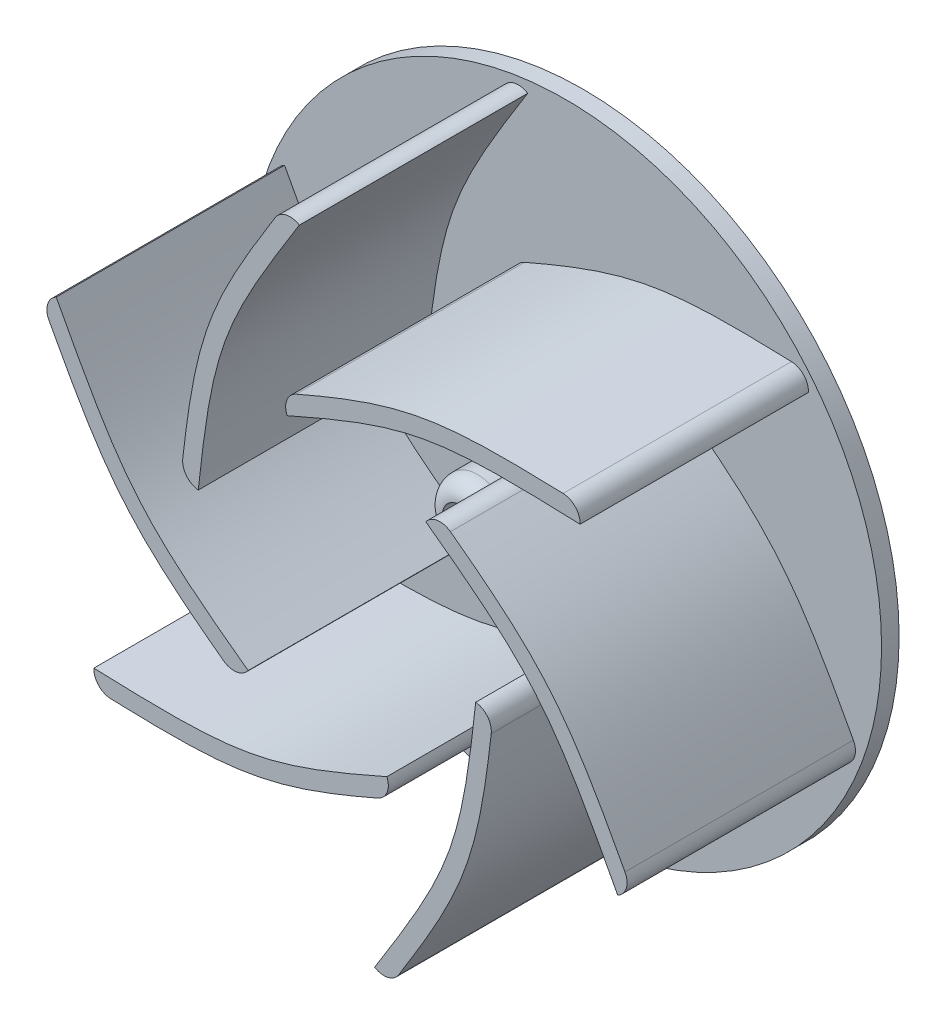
ISO-10303-21;
HEADER;
FILE_DESCRIPTION(('STEP AP214'),'2;1');
FILE_NAME('part.step','',(''),(''),'','','');
FILE_SCHEMA(('AUTOMOTIVE_DESIGN { 1 0 10303 214 1 1 1 1 }'));
ENDSEC;
DATA;
#1=APPLICATION_CONTEXT('core data for automotive mechanical design processes');
#2=APPLICATION_PROTOCOL_DEFINITION('international standard','automotive_design',2000,#1);
#3=PRODUCT_CONTEXT('',#1,'mechanical');
#4=PRODUCT('Part','Part','',(#3));
#5=PRODUCT_RELATED_PRODUCT_CATEGORY('part','',(#4));
#6=PRODUCT_DEFINITION_FORMATION('','',#4);
#7=PRODUCT_DEFINITION_CONTEXT('part definition',#1,'design');
#8=PRODUCT_DEFINITION('design','',#6,#7);
#9=PRODUCT_DEFINITION_SHAPE('','',#8);
#10=(LENGTH_UNIT() NAMED_UNIT(*) SI_UNIT(.MILLI.,.METRE.));
#11=(NAMED_UNIT(*) PLANE_ANGLE_UNIT() SI_UNIT($,.RADIAN.));
#12=(NAMED_UNIT(*) SI_UNIT($,.STERADIAN.) SOLID_ANGLE_UNIT());
#13=UNCERTAINTY_MEASURE_WITH_UNIT(LENGTH_MEASURE(1.E-05),#10,'distance_accuracy_value','');
#14=(GEOMETRIC_REPRESENTATION_CONTEXT(3) GLOBAL_UNCERTAINTY_ASSIGNED_CONTEXT((#13)) GLOBAL_UNIT_ASSIGNED_CONTEXT((#10,
#11,#12)) REPRESENTATION_CONTEXT('',''));
#15=CARTESIAN_POINT('',(0.,0.,0.));
#16=DIRECTION('',(0.,0.,1.));
#17=DIRECTION('',(1.,0.,0.));
#18=AXIS2_PLACEMENT_3D('',#15,#16,#17);
#19=CARTESIAN_POINT('',(0.,0.,0.));
#20=DIRECTION('',(0.,0.,1.));
#21=DIRECTION('',(1.,0.,0.));
#22=AXIS2_PLACEMENT_3D('',#19,#20,#21);
#23=PLANE('',#22);
#24=CARTESIAN_POINT('',(0.,0.,0.));
#25=DIRECTION('',(0.,0.,1.));
#26=DIRECTION('',(1.,0.,0.));
#27=AXIS2_PLACEMENT_3D('',#24,#25,#26);
#28=CIRCLE('',#27,3.);
#29=CARTESIAN_POINT('',(3.,0.,0.));
#30=VERTEX_POINT('',#29);
#31=EDGE_CURVE('E11',#30,#30,#28,.F.);
#32=ORIENTED_EDGE('',*,*,#31,.T.);
#33=EDGE_LOOP('',(#32));
#34=FACE_BOUND('',#33,.T.);
#35=CARTESIAN_POINT('',(0.,0.,0.));
#36=DIRECTION('',(0.,0.,1.));
#37=DIRECTION('',(1.,0.,0.));
#38=AXIS2_PLACEMENT_3D('',#35,#36,#37);
#39=CIRCLE('',#38,18.);
#40=CARTESIAN_POINT('',(-13.8758181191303,-11.4656736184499,0.));
#41=VERTEX_POINT('',#40);
#42=CARTESIAN_POINT('',(2.99165556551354,-17.7496477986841,0.));
#43=VERTEX_POINT('',#42);
#44=EDGE_CURVE('E1087',#41,#43,#39,.T.);
#45=ORIENTED_EDGE('',*,*,#44,.T.);
#46=CARTESIAN_POINT('',(16.8674736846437,-6.28397418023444,0.));
#47=VERTEX_POINT('',#46);
#48=EDGE_CURVE('E292',#43,#47,#39,.T.);
#49=ORIENTED_EDGE('',*,*,#48,.T.);
#50=CARTESIAN_POINT('',(13.8758181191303,11.4656736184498,0.));
#51=VERTEX_POINT('',#50);
#52=EDGE_CURVE('E298',#47,#51,#39,.T.);
#53=ORIENTED_EDGE('',*,*,#52,.T.);
#54=CARTESIAN_POINT('',(-2.99165556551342,17.7496477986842,0.));
#55=VERTEX_POINT('',#54);
#56=EDGE_CURVE('E302',#51,#55,#39,.T.);
#57=ORIENTED_EDGE('',*,*,#56,.T.);
#58=CARTESIAN_POINT('',(-16.8674736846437,6.28397418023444,0.));
#59=VERTEX_POINT('',#58);
#60=EDGE_CURVE('E1092',#55,#59,#39,.T.);
#61=ORIENTED_EDGE('',*,*,#60,.T.);
#62=EDGE_CURVE('E1090',#59,#41,#39,.T.);
#63=ORIENTED_EDGE('',*,*,#62,.T.);
#64=EDGE_LOOP('',(#45,#49,#53,#57,#61,#63));
#65=FACE_BOUND('',#64,.T.);
#66=CARTESIAN_POINT('',(2.67264177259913,-16.3708348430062,0.));
#67=DIRECTION('',(0.,0.,1.));
#68=DIRECTION('',(1.,0.,0.));
#69=AXIS2_PLACEMENT_3D('',#66,#67,#68);
#70=CIRCLE('',#69,1.);
#71=CARTESIAN_POINT('',(3.52226770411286,-16.8982206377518,0.));
#72=VERTEX_POINT('',#71);
#73=CARTESIAN_POINT('',(2.14373937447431,-17.2195175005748,0.));
#74=VERTEX_POINT('',#73);
#75=EDGE_CURVE('E248',#72,#74,#70,.F.);
#76=ORIENTED_EDGE('',*,*,#75,.T.);
#77=CARTESIAN_POINT('',(7.89663166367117,-1.28187689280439,0.));
#78=CARTESIAN_POINT('',(7.07674008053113,-8.91136628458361,0.));
#79=CARTESIAN_POINT('',(6.40891588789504,-10.3975866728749,0.));
#80=CARTESIAN_POINT('',(2.14373937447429,-17.2195175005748,0.));
#81=B_SPLINE_CURVE_WITH_KNOTS('',3,(#77,#78,#79,#80),.UNSPECIFIED.,.F.,.F.,(4,4),(0.,
0.864171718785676),.UNSPECIFIED.);
#82=CARTESIAN_POINT('',(7.89663166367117,-1.28187689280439,0.));
#83=VERTEX_POINT('',#82);
#84=EDGE_CURVE('E62',#83,#74,#81,.T.);
#85=ORIENTED_EDGE('',*,*,#84,.F.);
#86=CARTESIAN_POINT('',(7.78651000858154,-2.27579500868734,0.));
#87=DIRECTION('',(0.,0.,1.));
#88=DIRECTION('',(1.,0.,0.));
#89=AXIS2_PLACEMENT_3D('',#86,#87,#88);
#90=CIRCLE('',#89,1.);
#91=CARTESIAN_POINT('',(8.78000509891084,-2.38966996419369,0.));
#92=VERTEX_POINT('',#91);
#93=EDGE_CURVE('E374',#83,#92,#90,.F.);
#94=ORIENTED_EDGE('',*,*,#93,.T.);
#95=CARTESIAN_POINT('',(2.99165556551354,-17.7496477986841,0.));
#96=CARTESIAN_POINT('',(3.12206136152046,-17.5410704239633,0.));
#97=CARTESIAN_POINT('',(3.3869971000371,-17.1165011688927,0.));
#98=CARTESIAN_POINT('',(3.8788516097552,-16.3235412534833,0.));
#99=CARTESIAN_POINT('',(4.44981063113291,-15.3912618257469,0.));
#100=CARTESIAN_POINT('',(5.0627003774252,-14.3618193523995,0.));
#101=CARTESIAN_POINT('',(5.79400695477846,-13.0800621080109,0.));
#102=CARTESIAN_POINT('',(6.55968512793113,-11.6058919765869,0.));
#103=CARTESIAN_POINT('',(7.27860493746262,-9.90705395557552,0.));
#104=CARTESIAN_POINT('',(7.82881135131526,-8.16171238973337,0.));
#105=CARTESIAN_POINT('',(8.17869186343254,-6.5773524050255,0.));
#106=CARTESIAN_POINT('',(8.4172318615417,-5.16985897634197,0.));
#107=CARTESIAN_POINT('',(8.58149422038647,-4.02806967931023,0.));
#108=CARTESIAN_POINT('',(8.71151419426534,-2.98714418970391,0.));
#109=CARTESIAN_POINT('',(8.81358244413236,-2.09898226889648,0.));
#110=CARTESIAN_POINT('',(8.86574560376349,-1.62286418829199,0.));
#111=CARTESIAN_POINT('',(8.8909069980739,-1.3887251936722,0.));
#112=B_SPLINE_CURVE_WITH_KNOTS('',3,(#95,#96,#97,#98,#99,#100,#101,#102,#103,#104,#105,#106,
#107,#108,#109,#110,#111),.UNSPECIFIED.,.F.,.F.,(4,1,1,1,1,1,1,1,1,1,1,1,1,1,4),(0.,
0.0270053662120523,0.0540107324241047,0.10802146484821,0.162032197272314,0.216042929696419,
0.324064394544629,0.432085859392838,0.540107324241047,0.648128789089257,0.702139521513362,
0.756150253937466,0.810160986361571,0.837166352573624,0.864171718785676),.UNSPECIFIED.);
#113=EDGE_CURVE('E233',#72,#92,#112,.T.);
#114=ORIENTED_EDGE('',*,*,#113,.F.);
#115=EDGE_LOOP('',(#76,#85,#94,#114));
#116=FACE_BOUND('',#115,.T.);
#117=CARTESIAN_POINT('',(-12.8412379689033,-10.4999930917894,0.));
#118=DIRECTION('',(0.,0.,1.));
#119=DIRECTION('',(1.,0.,0.));
#120=AXIS2_PLACEMENT_3D('',#117,#118,#119);
#121=CIRCLE('',#120,1.);
#122=CARTESIAN_POINT('',(-12.8731544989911,-11.4994836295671,0.));
#123=VERTEX_POINT('',#122);
#124=CARTESIAN_POINT('',(-13.8406699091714,-10.4662915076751,0.));
#125=VERTEX_POINT('',#124);
#126=EDGE_CURVE('E254',#123,#125,#121,.F.);
#127=ORIENTED_EDGE('',*,*,#126,.T.);
#128=CARTESIAN_POINT('',(2.8381778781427,-7.47962207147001,0.));
#129=CARTESIAN_POINT('',(-4.17909954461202,-10.5843198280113,0.));
#130=CARTESIAN_POINT('',(-5.80011625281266,-10.7490773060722,0.));
#131=CARTESIAN_POINT('',(-13.8406699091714,-10.4662915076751,0.));
#132=B_SPLINE_CURVE_WITH_KNOTS('',3,(#128,#129,#130,#131),.UNSPECIFIED.,.F.,.F.,(4,4),(0.,
0.864171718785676),.UNSPECIFIED.);
#133=CARTESIAN_POINT('',(2.8381778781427,-7.47962207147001,0.));
#134=VERTEX_POINT('',#133);
#135=EDGE_CURVE('E240',#134,#125,#132,.T.);
#136=ORIENTED_EDGE('',*,*,#135,.F.);
#137=CARTESIAN_POINT('',(1.92235871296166,-7.88121297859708,0.));
#138=DIRECTION('',(0.,0.,1.));
#139=DIRECTION('',(1.,0.,0.));
#140=AXIS2_PLACEMENT_3D('',#137,#138,#139);
#141=CIRCLE('',#140,1.);
#142=CARTESIAN_POINT('',(2.32048765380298,-8.79854244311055,0.));
#143=VERTEX_POINT('',#142);
#144=EDGE_CURVE('E364',#134,#143,#141,.F.);
#145=ORIENTED_EDGE('',*,*,#144,.T.);
#146=CARTESIAN_POINT('',(-13.8758181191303,-11.4656736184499,0.));
#147=CARTESIAN_POINT('',(-13.6299819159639,-11.4743196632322,0.));
#148=CARTESIAN_POINT('',(-13.1298262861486,-11.4914761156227,0.));
#149=CARTESIAN_POINT('',(-12.1971756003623,-11.5209546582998,0.));
#150=CARTESIAN_POINT('',(-11.1043184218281,-11.5492799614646,0.));
#151=CARTESIAN_POINT('',(-9.90635021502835,-11.565336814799,0.));
#152=CARTESIAN_POINT('',(-8.4306625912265,-11.5577882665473,0.));
#153=CARTESIAN_POINT('',(-6.7711547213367,-11.4837999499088,0.));
#154=CARTESIAN_POINT('',(-4.94045793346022,-11.2569837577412,0.));
#155=CARTESIAN_POINT('',(-3.1538445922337,-10.8608057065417,0.));
#156=CARTESIAN_POINT('',(-1.60680834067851,-10.3716311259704,0.));
#157=CARTESIAN_POINT('',(-0.268613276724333,-9.87446610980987,0.));
#158=CARTESIAN_POINT('',(0.80233643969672,-9.44582683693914,0.));
#159=CARTESIAN_POINT('',(1.76881434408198,-9.03796469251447,0.));
#160=CARTESIAN_POINT('',(2.58901925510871,-8.68227742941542,0.));
#161=CARTESIAN_POINT('',(3.02743118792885,-8.48939301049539,0.));
#162=CARTESIAN_POINT('',(3.24278220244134,-8.39411391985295,0.));
#163=B_SPLINE_CURVE_WITH_KNOTS('',3,(#146,#147,#148,#149,#150,#151,#152,#153,#154,#155,#156,
#157,#158,#159,#160,#161,#162),.UNSPECIFIED.,.F.,.F.,(4,1,1,1,1,1,1,1,1,1,1,1,1,1,4),(0.,
0.0270053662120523,0.0540107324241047,0.10802146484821,0.162032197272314,0.216042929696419,
0.324064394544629,0.432085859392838,0.540107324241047,0.648128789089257,0.702139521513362,
0.756150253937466,0.810160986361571,0.837166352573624,0.864171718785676),.UNSPECIFIED.);
#164=EDGE_CURVE('E424',#123,#143,#163,.T.);
#165=ORIENTED_EDGE('',*,*,#164,.F.);
#166=EDGE_LOOP('',(#127,#136,#145,#165));
#167=FACE_BOUND('',#166,.T.);
#168=CARTESIAN_POINT('',(-15.5138797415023,5.87084175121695,0.));
#169=DIRECTION('',(0.,0.,1.));
#170=DIRECTION('',(1.,0.,0.));
#171=AXIS2_PLACEMENT_3D('',#168,#169,#170);
#172=CIRCLE('',#171,1.);
#173=CARTESIAN_POINT('',(-16.3954222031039,5.39873700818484,0.));
#174=VERTEX_POINT('',#173);
#175=CARTESIAN_POINT('',(-15.9844092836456,6.75322599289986,0.));
#176=VERTEX_POINT('',#175);
#177=EDGE_CURVE('E407',#174,#176,#172,.F.);
#178=ORIENTED_EDGE('',*,*,#177,.T.);
#179=CARTESIAN_POINT('',(-5.05845378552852,-6.19774517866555,0.));
#180=CARTESIAN_POINT('',(-11.2558396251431,-1.67295354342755,0.));
#181=CARTESIAN_POINT('',(-12.2090321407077,-0.351490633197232,0.));
#182=CARTESIAN_POINT('',(-15.9844092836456,6.7532259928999,0.));
#183=B_SPLINE_CURVE_WITH_KNOTS('',3,(#179,#180,#181,#182),.UNSPECIFIED.,.F.,.F.,(4,4),(0.,
0.864171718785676),.UNSPECIFIED.);
#184=CARTESIAN_POINT('',(-5.05845378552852,-6.19774517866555,0.));
#185=VERTEX_POINT('',#184);
#186=EDGE_CURVE('E434',#185,#176,#183,.T.);
#187=ORIENTED_EDGE('',*,*,#186,.F.);
#188=CARTESIAN_POINT('',(-5.86415129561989,-5.60541796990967,0.));
#189=DIRECTION('',(0.,0.,1.));
#190=DIRECTION('',(1.,0.,0.));
#191=AXIS2_PLACEMENT_3D('',#188,#189,#190);
#192=CIRCLE('',#191,1.);
#193=CARTESIAN_POINT('',(-6.45951744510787,-6.40887247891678,0.));
#194=VERTEX_POINT('',#193);
#195=EDGE_CURVE('E353',#185,#194,#192,.F.);
#196=ORIENTED_EDGE('',*,*,#195,.T.);
#197=CARTESIAN_POINT('',(-16.8674736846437,6.28397418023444,0.));
#198=CARTESIAN_POINT('',(-16.7520432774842,6.0667507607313,0.));
#199=CARTESIAN_POINT('',(-16.5168233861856,5.6250250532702,0.));
#200=CARTESIAN_POINT('',(-16.0760272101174,4.80258659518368,0.));
#201=CARTESIAN_POINT('',(-15.5541290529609,3.84198186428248,0.));
#202=CARTESIAN_POINT('',(-14.9690505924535,2.79648253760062,0.));
#203=CARTESIAN_POINT('',(-14.2246695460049,1.52227384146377,0.));
#204=CARTESIAN_POINT('',(-13.3308398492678,0.122092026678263,0.));
#205=CARTESIAN_POINT('',(-12.2190628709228,-1.34992980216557,0.));
#206=CARTESIAN_POINT('',(-10.982655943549,-2.69909331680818,0.));
#207=CARTESIAN_POINT('',(-9.78550020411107,-3.7942787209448,0.));
#208=CARTESIAN_POINT('',(-8.68584513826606,-4.7046071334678,0.));
#209=CARTESIAN_POINT('',(-7.77915778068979,-5.41775715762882,0.));
#210=CARTESIAN_POINT('',(-6.94269985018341,-6.05082050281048,0.));
#211=CARTESIAN_POINT('',(-6.22456318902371,-6.58329516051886,0.));
#212=CARTESIAN_POINT('',(-5.8383144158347,-6.86652882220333,0.));
#213=CARTESIAN_POINT('',(-5.64812479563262,-7.00538872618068,0.));
#214=B_SPLINE_CURVE_WITH_KNOTS('',3,(#197,#198,#199,#200,#201,#202,#203,#204,#205,#206,#207,
#208,#209,#210,#211,#212,#213),.UNSPECIFIED.,.F.,.F.,(4,1,1,1,1,1,1,1,1,1,1,1,1,1,4),(0.,
0.0270053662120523,0.0540107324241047,0.10802146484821,0.162032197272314,0.216042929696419,
0.324064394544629,0.432085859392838,0.540107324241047,0.648128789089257,0.702139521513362,
0.756150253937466,0.810160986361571,0.837166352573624,0.864171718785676),.UNSPECIFIED.);
#215=EDGE_CURVE('E439',#174,#194,#214,.T.);
#216=ORIENTED_EDGE('',*,*,#215,.F.);
#217=EDGE_LOOP('',(#178,#187,#196,#216));
#218=FACE_BOUND('',#217,.T.);
#219=CARTESIAN_POINT('',(-2.67264177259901,16.3708348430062,0.));
#220=DIRECTION('',(0.,0.,1.));
#221=DIRECTION('',(1.,0.,0.));
#222=AXIS2_PLACEMENT_3D('',#219,#220,#221);
#223=CIRCLE('',#222,1.);
#224=CARTESIAN_POINT('',(-3.52226770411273,16.8982206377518,0.));
#225=VERTEX_POINT('',#224);
#226=CARTESIAN_POINT('',(-2.14373937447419,17.2195175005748,0.));
#227=VERTEX_POINT('',#226);
#228=EDGE_CURVE('E396',#225,#227,#223,.F.);
#229=ORIENTED_EDGE('',*,*,#228,.T.);
#230=CARTESIAN_POINT('',(-7.89663166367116,1.28187689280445,0.));
#231=CARTESIAN_POINT('',(-7.07674008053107,8.91136628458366,0.));
#232=CARTESIAN_POINT('',(-6.40891588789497,10.3975866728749,0.));
#233=CARTESIAN_POINT('',(-2.14373937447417,17.2195175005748,0.));
#234=B_SPLINE_CURVE_WITH_KNOTS('',3,(#230,#231,#232,#233),.UNSPECIFIED.,.F.,.F.,(4,4),(0.,
0.864171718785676),.UNSPECIFIED.);
#235=CARTESIAN_POINT('',(-7.89663166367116,1.28187689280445,0.));
#236=VERTEX_POINT('',#235);
#237=EDGE_CURVE('E491',#236,#227,#234,.T.);
#238=ORIENTED_EDGE('',*,*,#237,.F.);
#239=CARTESIAN_POINT('',(-7.78651000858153,2.27579500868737,0.));
#240=DIRECTION('',(0.,0.,1.));
#241=DIRECTION('',(1.,0.,0.));
#242=AXIS2_PLACEMENT_3D('',#239,#240,#241);
#243=CIRCLE('',#242,1.);
#244=CARTESIAN_POINT('',(-8.78000509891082,2.38966996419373,0.));
#245=VERTEX_POINT('',#244);
#246=EDGE_CURVE('E342',#236,#245,#243,.F.);
#247=ORIENTED_EDGE('',*,*,#246,.T.);
#248=CARTESIAN_POINT('',(-2.99165556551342,17.7496477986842,0.));
#249=CARTESIAN_POINT('',(-3.12206136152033,17.5410704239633,0.));
#250=CARTESIAN_POINT('',(-3.38699710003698,17.1165011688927,0.));
#251=CARTESIAN_POINT('',(-3.87885160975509,16.3235412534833,0.));
#252=CARTESIAN_POINT('',(-4.4498106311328,15.391261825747,0.));
#253=CARTESIAN_POINT('',(-5.0627003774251,14.3618193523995,0.));
#254=CARTESIAN_POINT('',(-5.79400695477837,13.080062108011,0.));
#255=CARTESIAN_POINT('',(-6.55968512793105,11.6058919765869,0.));
#256=CARTESIAN_POINT('',(-7.27860493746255,9.90705395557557,0.));
#257=CARTESIAN_POINT('',(-7.8288113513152,8.16171238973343,0.));
#258=CARTESIAN_POINT('',(-8.17869186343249,6.57735240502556,0.));
#259=CARTESIAN_POINT('',(-8.41723186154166,5.16985897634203,0.));
#260=CARTESIAN_POINT('',(-8.58149422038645,4.02806967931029,0.));
#261=CARTESIAN_POINT('',(-8.71151419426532,2.98714418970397,0.));
#262=CARTESIAN_POINT('',(-8.81358244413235,2.09898226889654,0.));
#263=CARTESIAN_POINT('',(-8.86574560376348,1.62286418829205,0.));
#264=CARTESIAN_POINT('',(-8.89090699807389,1.38872519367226,0.));
#265=B_SPLINE_CURVE_WITH_KNOTS('',3,(#248,#249,#250,#251,#252,#253,#254,#255,#256,#257,#258,
#259,#260,#261,#262,#263,#264),.UNSPECIFIED.,.F.,.F.,(4,1,1,1,1,1,1,1,1,1,1,1,1,1,4),(0.,
0.0270053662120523,0.0540107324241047,0.10802146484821,0.162032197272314,0.216042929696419,
0.324064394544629,0.432085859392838,0.540107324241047,0.648128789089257,0.702139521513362,
0.756150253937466,0.810160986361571,0.837166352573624,0.864171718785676),.UNSPECIFIED.);
#266=EDGE_CURVE('E499',#225,#245,#265,.T.);
#267=ORIENTED_EDGE('',*,*,#266,.F.);
#268=EDGE_LOOP('',(#229,#238,#247,#267));
#269=FACE_BOUND('',#268,.T.);
#270=CARTESIAN_POINT('',(15.5138797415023,-5.87084175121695,0.));
#271=DIRECTION('',(0.,0.,1.));
#272=DIRECTION('',(1.,0.,0.));
#273=AXIS2_PLACEMENT_3D('',#270,#271,#272);
#274=CIRCLE('',#273,1.);
#275=CARTESIAN_POINT('',(16.3954222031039,-5.39873700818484,0.));
#276=VERTEX_POINT('',#275);
#277=CARTESIAN_POINT('',(15.9844092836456,-6.75322599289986,0.));
#278=VERTEX_POINT('',#277);
#279=EDGE_CURVE('E320',#276,#278,#274,.F.);
#280=ORIENTED_EDGE('',*,*,#279,.T.);
#281=CARTESIAN_POINT('',(5.05845378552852,6.19774517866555,0.));
#282=CARTESIAN_POINT('',(11.2558396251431,1.67295354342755,0.));
#283=CARTESIAN_POINT('',(12.2090321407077,0.351490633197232,0.));
#284=CARTESIAN_POINT('',(15.9844092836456,-6.7532259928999,0.));
#285=B_SPLINE_CURVE_WITH_KNOTS('',3,(#281,#282,#283,#284),.UNSPECIFIED.,.F.,.F.,(4,4),(0.,
0.864171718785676),.UNSPECIFIED.);
#286=CARTESIAN_POINT('',(5.05845378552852,6.19774517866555,0.));
#287=VERTEX_POINT('',#286);
#288=EDGE_CURVE('E567',#287,#278,#285,.T.);
#289=ORIENTED_EDGE('',*,*,#288,.F.);
#290=CARTESIAN_POINT('',(5.86415129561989,5.60541796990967,0.));
#291=DIRECTION('',(0.,0.,1.));
#292=DIRECTION('',(1.,0.,0.));
#293=AXIS2_PLACEMENT_3D('',#290,#291,#292);
#294=CIRCLE('',#293,1.);
#295=CARTESIAN_POINT('',(6.45951744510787,6.40887247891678,0.));
#296=VERTEX_POINT('',#295);
#297=EDGE_CURVE('E309',#287,#296,#294,.F.);
#298=ORIENTED_EDGE('',*,*,#297,.T.);
#299=CARTESIAN_POINT('',(16.8674736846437,-6.28397418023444,0.));
#300=CARTESIAN_POINT('',(16.7520432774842,-6.0667507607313,0.));
#301=CARTESIAN_POINT('',(16.5168233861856,-5.6250250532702,0.));
#302=CARTESIAN_POINT('',(16.0760272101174,-4.80258659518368,0.));
#303=CARTESIAN_POINT('',(15.5541290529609,-3.84198186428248,0.));
#304=CARTESIAN_POINT('',(14.9690505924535,-2.79648253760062,0.));
#305=CARTESIAN_POINT('',(14.2246695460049,-1.52227384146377,0.));
#306=CARTESIAN_POINT('',(13.3308398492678,-0.122092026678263,0.));
#307=CARTESIAN_POINT('',(12.2190628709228,1.34992980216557,0.));
#308=CARTESIAN_POINT('',(10.982655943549,2.69909331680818,0.));
#309=CARTESIAN_POINT('',(9.78550020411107,3.7942787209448,0.));
#310=CARTESIAN_POINT('',(8.68584513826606,4.7046071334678,0.));
#311=CARTESIAN_POINT('',(7.77915778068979,5.41775715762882,0.));
#312=CARTESIAN_POINT('',(6.94269985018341,6.05082050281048,0.));
#313=CARTESIAN_POINT('',(6.22456318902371,6.58329516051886,0.));
#314=CARTESIAN_POINT('',(5.8383144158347,6.86652882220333,0.));
#315=CARTESIAN_POINT('',(5.64812479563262,7.00538872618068,0.));
#316=B_SPLINE_CURVE_WITH_KNOTS('',3,(#299,#300,#301,#302,#303,#304,#305,#306,#307,#308,#309,
#310,#311,#312,#313,#314,#315),.UNSPECIFIED.,.F.,.F.,(4,1,1,1,1,1,1,1,1,1,1,1,1,1,4),(0.,
0.0270053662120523,0.0540107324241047,0.10802146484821,0.162032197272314,0.216042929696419,
0.324064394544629,0.432085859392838,0.540107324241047,0.648128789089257,0.702139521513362,
0.756150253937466,0.810160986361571,0.837166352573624,0.864171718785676),.UNSPECIFIED.);
#317=EDGE_CURVE('E575',#276,#296,#316,.T.);
#318=ORIENTED_EDGE('',*,*,#317,.F.);
#319=EDGE_LOOP('',(#280,#289,#298,#318));
#320=FACE_BOUND('',#319,.T.);
#321=CARTESIAN_POINT('',(12.8412379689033,10.4999930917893,0.));
#322=DIRECTION('',(0.,0.,1.));
#323=DIRECTION('',(1.,0.,0.));
#324=AXIS2_PLACEMENT_3D('',#321,#322,#323);
#325=CIRCLE('',#324,1.);
#326=CARTESIAN_POINT('',(12.8731544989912,11.499483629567,0.));
#327=VERTEX_POINT('',#326);
#328=CARTESIAN_POINT('',(13.8406699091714,10.466291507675,0.));
#329=VERTEX_POINT('',#328);
#330=EDGE_CURVE('E385',#327,#329,#325,.F.);
#331=ORIENTED_EDGE('',*,*,#330,.T.);
#332=CARTESIAN_POINT('',(-2.83817787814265,7.47962207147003,0.));
#333=CARTESIAN_POINT('',(4.17909954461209,10.5843198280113,0.));
#334=CARTESIAN_POINT('',(5.80011625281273,10.7490773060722,0.));
#335=CARTESIAN_POINT('',(13.8406699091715,10.466291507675,0.));
#336=B_SPLINE_CURVE_WITH_KNOTS('',3,(#332,#333,#334,#335),.UNSPECIFIED.,.F.,.F.,(4,4),(0.,
0.864171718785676),.UNSPECIFIED.);
#337=CARTESIAN_POINT('',(-2.83817787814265,7.47962207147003,0.));
#338=VERTEX_POINT('',#337);
#339=EDGE_CURVE('E518',#338,#329,#336,.T.);
#340=ORIENTED_EDGE('',*,*,#339,.F.);
#341=CARTESIAN_POINT('',(-1.92235871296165,7.88121297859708,0.));
#342=DIRECTION('',(0.,0.,1.));
#343=DIRECTION('',(1.,0.,0.));
#344=AXIS2_PLACEMENT_3D('',#341,#342,#343);
#345=CIRCLE('',#344,1.);
#346=CARTESIAN_POINT('',(-2.32048765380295,8.79854244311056,0.));
#347=VERTEX_POINT('',#346);
#348=EDGE_CURVE('E331',#338,#347,#345,.F.);
#349=ORIENTED_EDGE('',*,*,#348,.T.);
#350=CARTESIAN_POINT('',(13.8758181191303,11.4656736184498,0.));
#351=CARTESIAN_POINT('',(13.629981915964,11.4743196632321,0.));
#352=CARTESIAN_POINT('',(13.1298262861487,11.4914761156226,0.));
#353=CARTESIAN_POINT('',(12.1971756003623,11.5209546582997,0.));
#354=CARTESIAN_POINT('',(11.1043184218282,11.5492799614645,0.));
#355=CARTESIAN_POINT('',(9.90635021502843,11.5653368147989,0.));
#356=CARTESIAN_POINT('',(8.43066259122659,11.5577882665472,0.));
#357=CARTESIAN_POINT('',(6.77115472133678,11.4837999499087,0.));
#358=CARTESIAN_POINT('',(4.9404579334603,11.2569837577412,0.));
#359=CARTESIAN_POINT('',(3.15384459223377,10.8608057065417,0.));
#360=CARTESIAN_POINT('',(1.60680834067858,10.3716311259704,0.));
#361=CARTESIAN_POINT('',(0.268613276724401,9.87446610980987,0.));
#362=CARTESIAN_POINT('',(-0.802336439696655,9.44582683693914,0.));
#363=CARTESIAN_POINT('',(-1.76881434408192,9.03796469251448,0.));
#364=CARTESIAN_POINT('',(-2.58901925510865,8.68227742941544,0.));
#365=CARTESIAN_POINT('',(-3.02743118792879,8.48939301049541,0.));
#366=CARTESIAN_POINT('',(-3.24278220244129,8.39411391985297,0.));
#367=B_SPLINE_CURVE_WITH_KNOTS('',3,(#350,#351,#352,#353,#354,#355,#356,#357,#358,#359,#360,
#361,#362,#363,#364,#365,#366),.UNSPECIFIED.,.F.,.F.,(4,1,1,1,1,1,1,1,1,1,1,1,1,1,4),(0.,
0.0270053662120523,0.0540107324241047,0.10802146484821,0.162032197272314,0.216042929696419,
0.324064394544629,0.432085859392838,0.540107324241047,0.648128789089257,0.702139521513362,
0.756150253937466,0.810160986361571,0.837166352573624,0.864171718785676),.UNSPECIFIED.);
#368=EDGE_CURVE('E526',#327,#347,#367,.T.);
#369=ORIENTED_EDGE('',*,*,#368,.F.);
#370=EDGE_LOOP('',(#331,#340,#349,#369));
#371=FACE_BOUND('',#370,.T.);
#372=ADVANCED_FACE('F46',(#34,#65,#116,#167,#218,#269,#320,#371),#23,.T.);
#373=CARTESIAN_POINT('',(0.,0.,-1.));
#374=DIRECTION('',(0.,0.,1.));
#375=DIRECTION('',(1.,0.,0.));
#376=AXIS2_PLACEMENT_3D('',#373,#374,#375);
#377=CYLINDRICAL_SURFACE('',#376,18.);
#378=CARTESIAN_POINT('',(0.,0.,-1.));
#379=DIRECTION('',(0.,0.,1.));
#380=DIRECTION('',(1.,0.,0.));
#381=AXIS2_PLACEMENT_3D('',#378,#379,#380);
#382=CIRCLE('',#381,18.);
#383=CARTESIAN_POINT('',(18.,0.,-1.));
#384=VERTEX_POINT('',#383);
#385=EDGE_CURVE('E293',#384,#384,#382,.T.);
#386=ORIENTED_EDGE('',*,*,#385,.T.);
#387=EDGE_LOOP('',(#386));
#388=FACE_BOUND('',#387,.T.);
#389=ORIENTED_EDGE('',*,*,#52,.F.);
#390=ORIENTED_EDGE('',*,*,#48,.F.);
#391=ORIENTED_EDGE('',*,*,#44,.F.);
#392=ORIENTED_EDGE('',*,*,#62,.F.);
#393=ORIENTED_EDGE('',*,*,#60,.F.);
#394=ORIENTED_EDGE('',*,*,#56,.F.);
#395=EDGE_LOOP('',(#389,#390,#391,#392,#393,#394));
#396=FACE_BOUND('',#395,.T.);
#397=ADVANCED_FACE('F665',(#388,#396),#377,.T.);
#398=CARTESIAN_POINT('',(0.,0.,-1.));
#399=DIRECTION('',(0.,0.,1.));
#400=DIRECTION('',(1.,0.,0.));
#401=AXIS2_PLACEMENT_3D('',#398,#399,#400);
#402=PLANE('',#401);
#403=CARTESIAN_POINT('',(0.,0.,-1.));
#404=DIRECTION('',(0.,0.,1.));
#405=DIRECTION('',(1.,0.,0.));
#406=AXIS2_PLACEMENT_3D('',#403,#404,#405);
#407=CIRCLE('',#406,1.1);
#408=CARTESIAN_POINT('',(1.1,0.,-1.));
#409=VERTEX_POINT('',#408);
#410=EDGE_CURVE('E281',#409,#409,#407,.T.);
#411=ORIENTED_EDGE('',*,*,#410,.T.);
#412=EDGE_LOOP('',(#411));
#413=FACE_BOUND('',#412,.T.);
#414=ORIENTED_EDGE('',*,*,#385,.F.);
#415=EDGE_LOOP('',(#414));
#416=FACE_BOUND('',#415,.T.);
#417=ADVANCED_FACE('F671',(#413,#416),#402,.F.);
#418=CARTESIAN_POINT('',(0.,0.,-1.));
#419=DIRECTION('',(0.,0.,1.));
#420=DIRECTION('',(1.,0.,0.));
#421=AXIS2_PLACEMENT_3D('',#418,#419,#420);
#422=CYLINDRICAL_SURFACE('',#421,1.1);
#423=ORIENTED_EDGE('',*,*,#410,.F.);
#424=EDGE_LOOP('',(#423));
#425=FACE_BOUND('',#424,.T.);
#426=CARTESIAN_POINT('',(0.,0.,0.));
#427=DIRECTION('',(0.,0.,1.));
#428=DIRECTION('',(1.,0.,0.));
#429=AXIS2_PLACEMENT_3D('',#426,#427,#428);
#430=CIRCLE('',#429,1.1);
#431=CARTESIAN_POINT('',(1.1,0.,0.));
#432=VERTEX_POINT('',#431);
#433=EDGE_CURVE('E275',#432,#432,#430,.F.);
#434=ORIENTED_EDGE('',*,*,#433,.F.);
#435=EDGE_LOOP('',(#434));
#436=FACE_BOUND('',#435,.T.);
#437=ADVANCED_FACE('F1026',(#425,#436),#422,.F.);
#438=CARTESIAN_POINT('',(0.,0.,0.));
#439=DIRECTION('',(0.,0.,1.));
#440=DIRECTION('',(1.,0.,0.));
#441=AXIS2_PLACEMENT_3D('',#438,#439,#440);
#442=PLANE('',#441);
#443=CARTESIAN_POINT('',(0.,0.,0.));
#444=DIRECTION('',(0.,0.,1.));
#445=DIRECTION('',(1.,0.,0.));
#446=AXIS2_PLACEMENT_3D('',#443,#444,#445);
#447=CIRCLE('',#446,1.);
#448=CARTESIAN_POINT('',(1.,0.,0.));
#449=VERTEX_POINT('',#448);
#450=EDGE_CURVE('E276',#449,#449,#447,.T.);
#451=ORIENTED_EDGE('',*,*,#450,.T.);
#452=EDGE_LOOP('',(#451));
#453=FACE_BOUND('',#452,.T.);
#454=ORIENTED_EDGE('',*,*,#433,.T.);
#455=EDGE_LOOP('',(#454));
#456=FACE_BOUND('',#455,.T.);
#457=ADVANCED_FACE('F875',(#453,#456),#442,.F.);
#458=CARTESIAN_POINT('',(0.,0.,6.));
#459=DIRECTION('',(0.,0.,-1.));
#460=DIRECTION('',(-1.,0.,0.));
#461=AXIS2_PLACEMENT_3D('',#458,#459,#460);
#462=CYLINDRICAL_SURFACE('',#461,2.);
#463=CARTESIAN_POINT('',(0.,0.,5.));
#464=DIRECTION('',(0.,0.,1.));
#465=DIRECTION('',(1.,0.,0.));
#466=AXIS2_PLACEMENT_3D('',#463,#464,#465);
#467=CIRCLE('',#466,2.);
#468=CARTESIAN_POINT('',(2.,0.,5.));
#469=VERTEX_POINT('',#468);
#470=EDGE_CURVE('E55',#469,#469,#467,.F.);
#471=ORIENTED_EDGE('',*,*,#470,.T.);
#472=EDGE_LOOP('',(#471));
#473=FACE_BOUND('',#472,.T.);
#474=CARTESIAN_POINT('',(0.,0.,1.));
#475=DIRECTION('',(0.,0.,1.));
#476=DIRECTION('',(1.,0.,0.));
#477=AXIS2_PLACEMENT_3D('',#474,#475,#476);
#478=CIRCLE('',#477,2.);
#479=CARTESIAN_POINT('',(2.,0.,1.));
#480=VERTEX_POINT('',#479);
#481=EDGE_CURVE('E252',#480,#480,#478,.T.);
#482=ORIENTED_EDGE('',*,*,#481,.T.);
#483=EDGE_LOOP('',(#482));
#484=FACE_BOUND('',#483,.T.);
#485=ADVANCED_FACE('F264',(#473,#484),#462,.T.);
#486=CARTESIAN_POINT('',(0.,0.,6.));
#487=DIRECTION('',(0.,0.,-1.));
#488=DIRECTION('',(-1.,0.,0.));
#489=AXIS2_PLACEMENT_3D('',#486,#487,#488);
#490=CYLINDRICAL_SURFACE('',#489,1.);
#491=CARTESIAN_POINT('',(0.,0.,6.));
#492=DIRECTION('',(0.,0.,1.));
#493=DIRECTION('',(1.,0.,0.));
#494=AXIS2_PLACEMENT_3D('',#491,#492,#493);
#495=CIRCLE('',#494,1.);
#496=CARTESIAN_POINT('',(1.,0.,6.));
#497=VERTEX_POINT('',#496);
#498=EDGE_CURVE('E272',#497,#497,#495,.T.);
#499=ORIENTED_EDGE('',*,*,#498,.T.);
#500=EDGE_LOOP('',(#499));
#501=FACE_BOUND('',#500,.T.);
#502=ORIENTED_EDGE('',*,*,#450,.F.);
#503=EDGE_LOOP('',(#502));
#504=FACE_BOUND('',#503,.T.);
#505=ADVANCED_FACE('F874',(#501,#504),#490,.F.);
#506=CARTESIAN_POINT('',(5.05845378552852,6.19774517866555,13.));
#507=CARTESIAN_POINT('',(11.2558396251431,1.67295354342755,13.));
#508=CARTESIAN_POINT('',(12.2090321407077,0.351490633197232,13.));
#509=CARTESIAN_POINT('',(15.9844092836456,-6.7532259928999,13.));
#510=B_SPLINE_CURVE_WITH_KNOTS('',3,(#506,#507,#508,#509),.UNSPECIFIED.,.F.,.F.,(4,4),(0.,
0.864171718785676),.UNSPECIFIED.);
#511=DIRECTION('',(0.,0.,-1.));
#512=VECTOR('',#511,1.);
#513=SURFACE_OF_LINEAR_EXTRUSION('',#510,#512);
#514=ORIENTED_EDGE('',*,*,#288,.T.);
#515=DIRECTION('',(0.,0.,-1.));
#516=VECTOR('',#515,1.);
#517=CARTESIAN_POINT('',(15.9844092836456,-6.75322599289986,13.));
#518=LINE('',#517,#516);
#519=CARTESIAN_POINT('',(15.9844092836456,-6.75322599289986,13.));
#520=VERTEX_POINT('',#519);
#521=EDGE_CURVE('E284',#520,#278,#518,.T.);
#522=ORIENTED_EDGE('',*,*,#521,.F.);
#523=CARTESIAN_POINT('',(5.05845378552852,6.19774517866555,13.));
#524=VERTEX_POINT('',#523);
#525=EDGE_CURVE('E562',#524,#520,#510,.T.);
#526=ORIENTED_EDGE('',*,*,#525,.F.);
#527=DIRECTION('',(0.,0.,-1.));
#528=VECTOR('',#527,1.);
#529=CARTESIAN_POINT('',(5.05845378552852,6.19774517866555,13.));
#530=LINE('',#529,#528);
#531=EDGE_CURVE('E561',#524,#287,#530,.T.);
#532=ORIENTED_EDGE('',*,*,#531,.T.);
#533=EDGE_LOOP('',(#514,#522,#526,#532));
#534=FACE_BOUND('',#533,.T.);
#535=ADVANCED_FACE('F551',(#534),#513,.F.);
#536=CARTESIAN_POINT('',(16.8674736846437,-6.28397418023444,13.));
#537=CARTESIAN_POINT('',(16.7520432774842,-6.0667507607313,13.));
#538=CARTESIAN_POINT('',(16.5168233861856,-5.6250250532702,13.));
#539=CARTESIAN_POINT('',(16.0760272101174,-4.80258659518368,13.));
#540=CARTESIAN_POINT('',(15.5541290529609,-3.84198186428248,13.));
#541=CARTESIAN_POINT('',(14.9690505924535,-2.79648253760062,13.));
#542=CARTESIAN_POINT('',(14.2246695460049,-1.52227384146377,13.));
#543=CARTESIAN_POINT('',(13.3308398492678,-0.122092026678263,13.));
#544=CARTESIAN_POINT('',(12.2190628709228,1.34992980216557,13.));
#545=CARTESIAN_POINT('',(10.982655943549,2.69909331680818,13.));
#546=CARTESIAN_POINT('',(9.78550020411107,3.7942787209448,13.));
#547=CARTESIAN_POINT('',(8.68584513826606,4.7046071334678,13.));
#548=CARTESIAN_POINT('',(7.77915778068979,5.41775715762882,13.));
#549=CARTESIAN_POINT('',(6.94269985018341,6.05082050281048,13.));
#550=CARTESIAN_POINT('',(6.22456318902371,6.58329516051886,13.));
#551=CARTESIAN_POINT('',(5.8383144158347,6.86652882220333,13.));
#552=CARTESIAN_POINT('',(5.64812479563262,7.00538872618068,13.));
#553=B_SPLINE_CURVE_WITH_KNOTS('',3,(#536,#537,#538,#539,#540,#541,#542,#543,#544,#545,#546,
#547,#548,#549,#550,#551,#552),.UNSPECIFIED.,.F.,.F.,(4,1,1,1,1,1,1,1,1,1,1,1,1,1,4),(0.,
0.0270053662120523,0.0540107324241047,0.10802146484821,0.162032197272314,0.216042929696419,
0.324064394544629,0.432085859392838,0.540107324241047,0.648128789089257,0.702139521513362,
0.756150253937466,0.810160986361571,0.837166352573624,0.864171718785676),.UNSPECIFIED.);
#554=DIRECTION('',(0.,0.,-1.));
#555=VECTOR('',#554,1.);
#556=SURFACE_OF_LINEAR_EXTRUSION('',#553,#555);
#557=CARTESIAN_POINT('',(16.3954222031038,-5.39873700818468,13.));
#558=VERTEX_POINT('',#557);
#559=CARTESIAN_POINT('',(6.45951744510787,6.40887247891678,13.));
#560=VERTEX_POINT('',#559);
#561=EDGE_CURVE('E555',#558,#560,#553,.T.);
#562=ORIENTED_EDGE('',*,*,#561,.F.);
#563=DIRECTION('',(0.,0.,-1.));
#564=VECTOR('',#563,1.);
#565=CARTESIAN_POINT('',(16.3954222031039,-5.39873700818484,13.));
#566=LINE('',#565,#564);
#567=EDGE_CURVE('E313',#558,#276,#566,.T.);
#568=ORIENTED_EDGE('',*,*,#567,.T.);
#569=ORIENTED_EDGE('',*,*,#317,.T.);
#570=DIRECTION('',(0.,0.,-1.));
#571=VECTOR('',#570,1.);
#572=CARTESIAN_POINT('',(6.45951744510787,6.40887247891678,0.));
#573=LINE('',#572,#571);
#574=EDGE_CURVE('E297',#296,#560,#573,.F.);
#575=ORIENTED_EDGE('',*,*,#574,.T.);
#576=EDGE_LOOP('',(#562,#568,#569,#575));
#577=FACE_BOUND('',#576,.T.);
#578=ADVANCED_FACE('F546',(#577),#556,.F.);
#579=CARTESIAN_POINT('',(11.4296847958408,0.689731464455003,13.));
#580=DIRECTION('',(0.,0.,1.));
#581=DIRECTION('',(1.,0.,0.));
#582=AXIS2_PLACEMENT_3D('',#579,#580,#581);
#583=PLANE('',#582);
#584=ORIENTED_EDGE('',*,*,#525,.T.);
#585=CARTESIAN_POINT('',(15.5138797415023,-5.87084175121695,13.));
#586=DIRECTION('',(0.,0.,1.));
#587=DIRECTION('',(1.,0.,0.));
#588=AXIS2_PLACEMENT_3D('',#585,#586,#587);
#589=CIRCLE('',#588,1.);
#590=EDGE_CURVE('E317',#520,#558,#589,.T.);
#591=ORIENTED_EDGE('',*,*,#590,.T.);
#592=ORIENTED_EDGE('',*,*,#561,.T.);
#593=CARTESIAN_POINT('',(5.86415129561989,5.60541796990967,13.));
#594=DIRECTION('',(0.,0.,1.));
#595=DIRECTION('',(1.,0.,0.));
#596=AXIS2_PLACEMENT_3D('',#593,#594,#595);
#597=CIRCLE('',#596,1.);
#598=EDGE_CURVE('E306',#560,#524,#597,.T.);
#599=ORIENTED_EDGE('',*,*,#598,.T.);
#600=EDGE_LOOP('',(#584,#591,#592,#599));
#601=FACE_BOUND('',#600,.T.);
#602=ADVANCED_FACE('F542',(#601),#583,.T.);
#603=CARTESIAN_POINT('',(5.86415129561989,5.60541796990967,6.5));
#604=DIRECTION('',(0.,0.,-1.));
#605=DIRECTION('',(-1.,0.,0.));
#606=AXIS2_PLACEMENT_3D('',#603,#604,#605);
#607=CYLINDRICAL_SURFACE('',#606,1.);
#608=ORIENTED_EDGE('',*,*,#598,.F.);
#609=ORIENTED_EDGE('',*,*,#574,.F.);
#610=ORIENTED_EDGE('',*,*,#297,.F.);
#611=ORIENTED_EDGE('',*,*,#531,.F.);
#612=EDGE_LOOP('',(#608,#609,#610,#611));
#613=FACE_BOUND('',#612,.T.);
#614=ADVANCED_FACE('F545',(#613),#607,.T.);
#615=CARTESIAN_POINT('',(15.5138797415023,-5.87084175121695,6.50000000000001));
#616=DIRECTION('',(0.,0.,-1.));
#617=DIRECTION('',(-1.,0.,0.));
#618=AXIS2_PLACEMENT_3D('',#615,#616,#617);
#619=CYLINDRICAL_SURFACE('',#618,1.);
#620=ORIENTED_EDGE('',*,*,#590,.F.);
#621=ORIENTED_EDGE('',*,*,#521,.T.);
#622=ORIENTED_EDGE('',*,*,#279,.F.);
#623=ORIENTED_EDGE('',*,*,#567,.F.);
#624=EDGE_LOOP('',(#620,#621,#622,#623));
#625=FACE_BOUND('',#624,.T.);
#626=ADVANCED_FACE('F540',(#625),#619,.T.);
#627=CARTESIAN_POINT('',(-2.83817787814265,7.47962207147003,13.));
#628=CARTESIAN_POINT('',(4.17909954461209,10.5843198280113,13.));
#629=CARTESIAN_POINT('',(5.80011625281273,10.7490773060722,13.));
#630=CARTESIAN_POINT('',(13.8406699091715,10.466291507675,13.));
#631=B_SPLINE_CURVE_WITH_KNOTS('',3,(#627,#628,#629,#630),.UNSPECIFIED.,.F.,.F.,(4,4),(0.,
0.864171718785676),.UNSPECIFIED.);
#632=DIRECTION('',(0.,0.,-1.));
#633=VECTOR('',#632,1.);
#634=SURFACE_OF_LINEAR_EXTRUSION('',#631,#633);
#635=ORIENTED_EDGE('',*,*,#339,.T.);
#636=DIRECTION('',(0.,0.,-1.));
#637=VECTOR('',#636,1.);
#638=CARTESIAN_POINT('',(13.8406699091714,10.466291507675,13.));
#639=LINE('',#638,#637);
#640=CARTESIAN_POINT('',(13.8406699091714,10.466291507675,13.));
#641=VERTEX_POINT('',#640);
#642=EDGE_CURVE('E576',#641,#329,#639,.T.);
#643=ORIENTED_EDGE('',*,*,#642,.F.);
#644=CARTESIAN_POINT('',(-2.83817787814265,7.47962207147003,13.));
#645=VERTEX_POINT('',#644);
#646=EDGE_CURVE('E519',#645,#641,#631,.T.);
#647=ORIENTED_EDGE('',*,*,#646,.F.);
#648=DIRECTION('',(0.,0.,-1.));
#649=VECTOR('',#648,1.);
#650=CARTESIAN_POINT('',(-2.83817787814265,7.47962207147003,13.));
#651=LINE('',#650,#649);
#652=EDGE_CURVE('E608',#645,#338,#651,.T.);
#653=ORIENTED_EDGE('',*,*,#652,.T.);
#654=EDGE_LOOP('',(#635,#643,#647,#653));
#655=FACE_BOUND('',#654,.T.);
#656=ADVANCED_FACE('F535',(#655),#634,.F.);
#657=CARTESIAN_POINT('',(13.8758181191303,11.4656736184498,13.));
#658=CARTESIAN_POINT('',(13.629981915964,11.4743196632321,13.));
#659=CARTESIAN_POINT('',(13.1298262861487,11.4914761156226,13.));
#660=CARTESIAN_POINT('',(12.1971756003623,11.5209546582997,13.));
#661=CARTESIAN_POINT('',(11.1043184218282,11.5492799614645,13.));
#662=CARTESIAN_POINT('',(9.90635021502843,11.5653368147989,13.));
#663=CARTESIAN_POINT('',(8.43066259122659,11.5577882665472,13.));
#664=CARTESIAN_POINT('',(6.77115472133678,11.4837999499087,13.));
#665=CARTESIAN_POINT('',(4.9404579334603,11.2569837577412,13.));
#666=CARTESIAN_POINT('',(3.15384459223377,10.8608057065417,13.));
#667=CARTESIAN_POINT('',(1.60680834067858,10.3716311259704,13.));
#668=CARTESIAN_POINT('',(0.268613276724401,9.87446610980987,13.));
#669=CARTESIAN_POINT('',(-0.802336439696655,9.44582683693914,13.));
#670=CARTESIAN_POINT('',(-1.76881434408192,9.03796469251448,13.));
#671=CARTESIAN_POINT('',(-2.58901925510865,8.68227742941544,13.));
#672=CARTESIAN_POINT('',(-3.02743118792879,8.48939301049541,13.));
#673=CARTESIAN_POINT('',(-3.24278220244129,8.39411391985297,13.));
#674=B_SPLINE_CURVE_WITH_KNOTS('',3,(#657,#658,#659,#660,#661,#662,#663,#664,#665,#666,#667,
#668,#669,#670,#671,#672,#673),.UNSPECIFIED.,.F.,.F.,(4,1,1,1,1,1,1,1,1,1,1,1,1,1,4),(0.,
0.0270053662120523,0.0540107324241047,0.10802146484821,0.162032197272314,0.216042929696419,
0.324064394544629,0.432085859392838,0.540107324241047,0.648128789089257,0.702139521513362,
0.756150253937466,0.810160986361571,0.837166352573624,0.864171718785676),.UNSPECIFIED.);
#675=DIRECTION('',(0.,0.,-1.));
#676=VECTOR('',#675,1.);
#677=SURFACE_OF_LINEAR_EXTRUSION('',#674,#676);
#678=CARTESIAN_POINT('',(12.873154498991,11.499483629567,13.));
#679=VERTEX_POINT('',#678);
#680=CARTESIAN_POINT('',(-2.32048765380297,8.79854244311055,13.));
#681=VERTEX_POINT('',#680);
#682=EDGE_CURVE('E525',#679,#681,#674,.T.);
#683=ORIENTED_EDGE('',*,*,#682,.F.);
#684=DIRECTION('',(0.,0.,-1.));
#685=VECTOR('',#684,1.);
#686=CARTESIAN_POINT('',(12.8731544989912,11.499483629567,13.));
#687=LINE('',#686,#685);
#688=EDGE_CURVE('E378',#679,#327,#687,.T.);
#689=ORIENTED_EDGE('',*,*,#688,.T.);
#690=ORIENTED_EDGE('',*,*,#368,.T.);
#691=DIRECTION('',(0.,0.,-1.));
#692=VECTOR('',#691,1.);
#693=CARTESIAN_POINT('',(-2.32048765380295,8.79854244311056,0.));
#694=LINE('',#693,#692);
#695=EDGE_CURVE('E324',#347,#681,#694,.F.);
#696=ORIENTED_EDGE('',*,*,#695,.T.);
#697=EDGE_LOOP('',(#683,#689,#690,#696));
#698=FACE_BOUND('',#697,.T.);
#699=ADVANCED_FACE('F539',(#698),#677,.F.);
#700=CARTESIAN_POINT('',(5.11751742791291,10.2432631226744,13.));
#701=DIRECTION('',(0.,0.,1.));
#702=DIRECTION('',(0.499999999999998,0.86602540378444,0.));
#703=AXIS2_PLACEMENT_3D('',#700,#701,#702);
#704=PLANE('',#703);
#705=ORIENTED_EDGE('',*,*,#646,.T.);
#706=CARTESIAN_POINT('',(12.8412379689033,10.4999930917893,13.));
#707=DIRECTION('',(0.,0.,1.));
#708=DIRECTION('',(1.,0.,0.));
#709=AXIS2_PLACEMENT_3D('',#706,#707,#708);
#710=CIRCLE('',#709,1.);
#711=EDGE_CURVE('E382',#641,#679,#710,.T.);
#712=ORIENTED_EDGE('',*,*,#711,.T.);
#713=ORIENTED_EDGE('',*,*,#682,.T.);
#714=CARTESIAN_POINT('',(-1.92235871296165,7.88121297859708,13.));
#715=DIRECTION('',(0.,0.,1.));
#716=DIRECTION('',(1.,0.,0.));
#717=AXIS2_PLACEMENT_3D('',#714,#715,#716);
#718=CIRCLE('',#717,1.);
#719=EDGE_CURVE('E328',#681,#645,#718,.T.);
#720=ORIENTED_EDGE('',*,*,#719,.T.);
#721=EDGE_LOOP('',(#705,#712,#713,#720));
#722=FACE_BOUND('',#721,.T.);
#723=ADVANCED_FACE('F710',(#722),#704,.T.);
#724=CARTESIAN_POINT('',(-7.89663166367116,1.28187689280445,13.));
#725=CARTESIAN_POINT('',(-7.07674008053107,8.91136628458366,13.));
#726=CARTESIAN_POINT('',(-6.40891588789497,10.3975866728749,13.));
#727=CARTESIAN_POINT('',(-2.14373937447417,17.2195175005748,13.));
#728=B_SPLINE_CURVE_WITH_KNOTS('',3,(#724,#725,#726,#727),.UNSPECIFIED.,.F.,.F.,(4,4),(0.,
0.864171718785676),.UNSPECIFIED.);
#729=DIRECTION('',(0.,0.,-1.));
#730=VECTOR('',#729,1.);
#731=SURFACE_OF_LINEAR_EXTRUSION('',#728,#730);
#732=ORIENTED_EDGE('',*,*,#237,.T.);
#733=DIRECTION('',(0.,0.,-1.));
#734=VECTOR('',#733,1.);
#735=CARTESIAN_POINT('',(-2.14373937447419,17.2195175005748,13.));
#736=LINE('',#735,#734);
#737=CARTESIAN_POINT('',(-2.14373937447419,17.2195175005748,13.));
#738=VERTEX_POINT('',#737);
#739=EDGE_CURVE('E514',#738,#227,#736,.T.);
#740=ORIENTED_EDGE('',*,*,#739,.F.);
#741=CARTESIAN_POINT('',(-7.89663166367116,1.28187689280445,13.));
#742=VERTEX_POINT('',#741);
#743=EDGE_CURVE('E486',#742,#738,#728,.T.);
#744=ORIENTED_EDGE('',*,*,#743,.F.);
#745=DIRECTION('',(0.,0.,-1.));
#746=VECTOR('',#745,1.);
#747=CARTESIAN_POINT('',(-7.89663166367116,1.28187689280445,13.));
#748=LINE('',#747,#746);
#749=EDGE_CURVE('E485',#742,#236,#748,.T.);
#750=ORIENTED_EDGE('',*,*,#749,.T.);
#751=EDGE_LOOP('',(#732,#740,#744,#750));
#752=FACE_BOUND('',#751,.T.);
#753=ADVANCED_FACE('F475',(#752),#731,.F.);
#754=CARTESIAN_POINT('',(-2.99165556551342,17.7496477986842,13.));
#755=CARTESIAN_POINT('',(-3.12206136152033,17.5410704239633,13.));
#756=CARTESIAN_POINT('',(-3.38699710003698,17.1165011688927,13.));
#757=CARTESIAN_POINT('',(-3.87885160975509,16.3235412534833,13.));
#758=CARTESIAN_POINT('',(-4.4498106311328,15.391261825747,13.));
#759=CARTESIAN_POINT('',(-5.0627003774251,14.3618193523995,13.));
#760=CARTESIAN_POINT('',(-5.79400695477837,13.080062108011,13.));
#761=CARTESIAN_POINT('',(-6.55968512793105,11.6058919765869,13.));
#762=CARTESIAN_POINT('',(-7.27860493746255,9.90705395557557,13.));
#763=CARTESIAN_POINT('',(-7.8288113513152,8.16171238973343,13.));
#764=CARTESIAN_POINT('',(-8.17869186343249,6.57735240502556,13.));
#765=CARTESIAN_POINT('',(-8.41723186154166,5.16985897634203,13.));
#766=CARTESIAN_POINT('',(-8.58149422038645,4.02806967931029,13.));
#767=CARTESIAN_POINT('',(-8.71151419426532,2.98714418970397,13.));
#768=CARTESIAN_POINT('',(-8.81358244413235,2.09898226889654,13.));
#769=CARTESIAN_POINT('',(-8.86574560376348,1.62286418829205,13.));
#770=CARTESIAN_POINT('',(-8.89090699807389,1.38872519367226,13.));
#771=B_SPLINE_CURVE_WITH_KNOTS('',3,(#754,#755,#756,#757,#758,#759,#760,#761,#762,#763,#764,
#765,#766,#767,#768,#769,#770),.UNSPECIFIED.,.F.,.F.,(4,1,1,1,1,1,1,1,1,1,1,1,1,1,4),(0.,
0.0270053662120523,0.0540107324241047,0.10802146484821,0.162032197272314,0.216042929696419,
0.324064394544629,0.432085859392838,0.540107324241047,0.648128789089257,0.702139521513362,
0.756150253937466,0.810160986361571,0.837166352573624,0.864171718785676),.UNSPECIFIED.);
#772=DIRECTION('',(0.,0.,-1.));
#773=VECTOR('',#772,1.);
#774=SURFACE_OF_LINEAR_EXTRUSION('',#771,#773);
#775=CARTESIAN_POINT('',(-3.52226770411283,16.8982206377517,13.));
#776=VERTEX_POINT('',#775);
#777=CARTESIAN_POINT('',(-8.78000509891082,2.38966996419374,13.));
#778=VERTEX_POINT('',#777);
#779=EDGE_CURVE('E479',#776,#778,#771,.T.);
#780=ORIENTED_EDGE('',*,*,#779,.F.);
#781=DIRECTION('',(0.,0.,-1.));
#782=VECTOR('',#781,1.);
#783=CARTESIAN_POINT('',(-3.52226770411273,16.8982206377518,13.));
#784=LINE('',#783,#782);
#785=EDGE_CURVE('E389',#776,#225,#784,.T.);
#786=ORIENTED_EDGE('',*,*,#785,.T.);
#787=ORIENTED_EDGE('',*,*,#266,.T.);
#788=DIRECTION('',(0.,0.,-1.));
#789=VECTOR('',#788,1.);
#790=CARTESIAN_POINT('',(-8.78000509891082,2.38966996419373,0.));
#791=LINE('',#790,#789);
#792=EDGE_CURVE('E335',#245,#778,#791,.F.);
#793=ORIENTED_EDGE('',*,*,#792,.T.);
#794=EDGE_LOOP('',(#780,#786,#787,#793));
#795=FACE_BOUND('',#794,.T.);
#796=ADVANCED_FACE('F470',(#795),#774,.F.);
#797=CARTESIAN_POINT('',(-6.31216736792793,9.55353165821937,13.));
#798=DIRECTION('',(0.,0.,1.));
#799=DIRECTION('',(-0.500000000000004,0.866025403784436,0.));
#800=AXIS2_PLACEMENT_3D('',#797,#798,#799);
#801=PLANE('',#800);
#802=ORIENTED_EDGE('',*,*,#743,.T.);
#803=CARTESIAN_POINT('',(-2.67264177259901,16.3708348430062,13.));
#804=DIRECTION('',(0.,0.,1.));
#805=DIRECTION('',(1.,0.,0.));
#806=AXIS2_PLACEMENT_3D('',#803,#804,#805);
#807=CIRCLE('',#806,1.);
#808=EDGE_CURVE('E393',#738,#776,#807,.T.);
#809=ORIENTED_EDGE('',*,*,#808,.T.);
#810=ORIENTED_EDGE('',*,*,#779,.T.);
#811=CARTESIAN_POINT('',(-7.78651000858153,2.27579500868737,13.));
#812=DIRECTION('',(0.,0.,1.));
#813=DIRECTION('',(1.,0.,0.));
#814=AXIS2_PLACEMENT_3D('',#811,#812,#813);
#815=CIRCLE('',#814,1.);
#816=EDGE_CURVE('E339',#778,#742,#815,.T.);
#817=ORIENTED_EDGE('',*,*,#816,.T.);
#818=EDGE_LOOP('',(#802,#809,#810,#817));
#819=FACE_BOUND('',#818,.T.);
#820=ADVANCED_FACE('F465',(#819),#801,.T.);
#821=CARTESIAN_POINT('',(-5.05845378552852,-6.19774517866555,13.));
#822=CARTESIAN_POINT('',(-11.2558396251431,-1.67295354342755,13.));
#823=CARTESIAN_POINT('',(-12.2090321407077,-0.351490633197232,13.));
#824=CARTESIAN_POINT('',(-15.9844092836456,6.7532259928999,13.));
#825=B_SPLINE_CURVE_WITH_KNOTS('',3,(#821,#822,#823,#824),.UNSPECIFIED.,.F.,.F.,(4,4),(0.,
0.864171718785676),.UNSPECIFIED.);
#826=DIRECTION('',(0.,0.,-1.));
#827=VECTOR('',#826,1.);
#828=SURFACE_OF_LINEAR_EXTRUSION('',#825,#827);
#829=ORIENTED_EDGE('',*,*,#186,.T.);
#830=DIRECTION('',(0.,0.,-1.));
#831=VECTOR('',#830,1.);
#832=CARTESIAN_POINT('',(-15.9844092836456,6.75322599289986,13.));
#833=LINE('',#832,#831);
#834=CARTESIAN_POINT('',(-15.9844092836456,6.75322599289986,13.));
#835=VERTEX_POINT('',#834);
#836=EDGE_CURVE('E500',#835,#176,#833,.T.);
#837=ORIENTED_EDGE('',*,*,#836,.F.);
#838=CARTESIAN_POINT('',(-5.05845378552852,-6.19774517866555,13.));
#839=VERTEX_POINT('',#838);
#840=EDGE_CURVE('E446',#839,#835,#825,.T.);
#841=ORIENTED_EDGE('',*,*,#840,.F.);
#842=DIRECTION('',(0.,0.,-1.));
#843=VECTOR('',#842,1.);
#844=CARTESIAN_POINT('',(-5.05845378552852,-6.19774517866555,13.));
#845=LINE('',#844,#843);
#846=EDGE_CURVE('E619',#839,#185,#845,.T.);
#847=ORIENTED_EDGE('',*,*,#846,.T.);
#848=EDGE_LOOP('',(#829,#837,#841,#847));
#849=FACE_BOUND('',#848,.T.);
#850=ADVANCED_FACE('F460',(#849),#828,.F.);
#851=CARTESIAN_POINT('',(-16.8674736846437,6.28397418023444,13.));
#852=CARTESIAN_POINT('',(-16.7520432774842,6.0667507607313,13.));
#853=CARTESIAN_POINT('',(-16.5168233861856,5.6250250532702,13.));
#854=CARTESIAN_POINT('',(-16.0760272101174,4.80258659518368,13.));
#855=CARTESIAN_POINT('',(-15.5541290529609,3.84198186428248,13.));
#856=CARTESIAN_POINT('',(-14.9690505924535,2.79648253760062,13.));
#857=CARTESIAN_POINT('',(-14.2246695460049,1.52227384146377,13.));
#858=CARTESIAN_POINT('',(-13.3308398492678,0.122092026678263,13.));
#859=CARTESIAN_POINT('',(-12.2190628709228,-1.34992980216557,13.));
#860=CARTESIAN_POINT('',(-10.982655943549,-2.69909331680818,13.));
#861=CARTESIAN_POINT('',(-9.78550020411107,-3.7942787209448,13.));
#862=CARTESIAN_POINT('',(-8.68584513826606,-4.7046071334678,13.));
#863=CARTESIAN_POINT('',(-7.77915778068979,-5.41775715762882,13.));
#864=CARTESIAN_POINT('',(-6.94269985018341,-6.05082050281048,13.));
#865=CARTESIAN_POINT('',(-6.22456318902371,-6.58329516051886,13.));
#866=CARTESIAN_POINT('',(-5.8383144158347,-6.86652882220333,13.));
#867=CARTESIAN_POINT('',(-5.64812479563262,-7.00538872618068,13.));
#868=B_SPLINE_CURVE_WITH_KNOTS('',3,(#851,#852,#853,#854,#855,#856,#857,#858,#859,#860,#861,
#862,#863,#864,#865,#866,#867),.UNSPECIFIED.,.F.,.F.,(4,1,1,1,1,1,1,1,1,1,1,1,1,1,4),(0.,
0.0270053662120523,0.0540107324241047,0.10802146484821,0.162032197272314,0.216042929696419,
0.324064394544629,0.432085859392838,0.540107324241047,0.648128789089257,0.702139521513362,
0.756150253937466,0.810160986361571,0.837166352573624,0.864171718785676),.UNSPECIFIED.);
#869=DIRECTION('',(0.,0.,-1.));
#870=VECTOR('',#869,1.);
#871=SURFACE_OF_LINEAR_EXTRUSION('',#868,#870);
#872=CARTESIAN_POINT('',(-16.3954222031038,5.39873700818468,13.));
#873=VERTEX_POINT('',#872);
#874=CARTESIAN_POINT('',(-6.45951744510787,-6.40887247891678,13.));
#875=VERTEX_POINT('',#874);
#876=EDGE_CURVE('E452',#873,#875,#868,.T.);
#877=ORIENTED_EDGE('',*,*,#876,.F.);
#878=DIRECTION('',(0.,0.,-1.));
#879=VECTOR('',#878,1.);
#880=CARTESIAN_POINT('',(-16.3954222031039,5.39873700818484,13.));
#881=LINE('',#880,#879);
#882=EDGE_CURVE('E400',#873,#174,#881,.T.);
#883=ORIENTED_EDGE('',*,*,#882,.T.);
#884=ORIENTED_EDGE('',*,*,#215,.T.);
#885=DIRECTION('',(0.,0.,-1.));
#886=VECTOR('',#885,1.);
#887=CARTESIAN_POINT('',(-6.45951744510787,-6.40887247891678,0.));
#888=LINE('',#887,#886);
#889=EDGE_CURVE('E346',#194,#875,#888,.F.);
#890=ORIENTED_EDGE('',*,*,#889,.T.);
#891=EDGE_LOOP('',(#877,#883,#884,#890));
#892=FACE_BOUND('',#891,.T.);
#893=ADVANCED_FACE('F464',(#892),#871,.F.);
#894=CARTESIAN_POINT('',(-11.4296847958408,-0.689731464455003,13.));
#895=DIRECTION('',(0.,0.,1.));
#896=DIRECTION('',(-1.,0.,0.));
#897=AXIS2_PLACEMENT_3D('',#894,#895,#896);
#898=PLANE('',#897);
#899=ORIENTED_EDGE('',*,*,#840,.T.);
#900=CARTESIAN_POINT('',(-15.5138797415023,5.87084175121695,13.));
#901=DIRECTION('',(0.,0.,1.));
#902=DIRECTION('',(1.,0.,0.));
#903=AXIS2_PLACEMENT_3D('',#900,#901,#902);
#904=CIRCLE('',#903,1.);
#905=EDGE_CURVE('E404',#835,#873,#904,.T.);
#906=ORIENTED_EDGE('',*,*,#905,.T.);
#907=ORIENTED_EDGE('',*,*,#876,.T.);
#908=CARTESIAN_POINT('',(-5.86415129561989,-5.60541796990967,13.));
#909=DIRECTION('',(0.,0.,1.));
#910=DIRECTION('',(1.,0.,0.));
#911=AXIS2_PLACEMENT_3D('',#908,#909,#910);
#912=CIRCLE('',#911,1.);
#913=EDGE_CURVE('E350',#875,#839,#912,.T.);
#914=ORIENTED_EDGE('',*,*,#913,.T.);
#915=EDGE_LOOP('',(#899,#906,#907,#914));
#916=FACE_BOUND('',#915,.T.);
#917=ADVANCED_FACE('F648',(#916),#898,.T.);
#918=CARTESIAN_POINT('',(2.8381778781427,-7.47962207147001,13.));
#919=CARTESIAN_POINT('',(-4.17909954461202,-10.5843198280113,13.));
#920=CARTESIAN_POINT('',(-5.80011625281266,-10.7490773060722,13.));
#921=CARTESIAN_POINT('',(-13.8406699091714,-10.4662915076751,13.));
#922=B_SPLINE_CURVE_WITH_KNOTS('',3,(#918,#919,#920,#921),.UNSPECIFIED.,.F.,.F.,(4,4),(0.,
0.864171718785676),.UNSPECIFIED.);
#923=DIRECTION('',(0.,0.,-1.));
#924=VECTOR('',#923,1.);
#925=SURFACE_OF_LINEAR_EXTRUSION('',#922,#924);
#926=ORIENTED_EDGE('',*,*,#135,.T.);
#927=DIRECTION('',(0.,0.,-1.));
#928=VECTOR('',#927,1.);
#929=CARTESIAN_POINT('',(-13.8406699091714,-10.4662915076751,13.));
#930=LINE('',#929,#928);
#931=CARTESIAN_POINT('',(-13.8406699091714,-10.4662915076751,13.));
#932=VERTEX_POINT('',#931);
#933=EDGE_CURVE('E429',#932,#125,#930,.T.);
#934=ORIENTED_EDGE('',*,*,#933,.F.);
#935=CARTESIAN_POINT('',(2.8381778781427,-7.47962207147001,13.));
#936=VERTEX_POINT('',#935);
#937=EDGE_CURVE('E1121',#936,#932,#922,.T.);
#938=ORIENTED_EDGE('',*,*,#937,.F.);
#939=DIRECTION('',(0.,0.,-1.));
#940=VECTOR('',#939,1.);
#941=CARTESIAN_POINT('',(2.8381778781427,-7.47962207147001,13.));
#942=LINE('',#941,#940);
#943=EDGE_CURVE('E435',#936,#134,#942,.T.);
#944=ORIENTED_EDGE('',*,*,#943,.T.);
#945=EDGE_LOOP('',(#926,#934,#938,#944));
#946=FACE_BOUND('',#945,.T.);
#947=ADVANCED_FACE('F761',(#946),#925,.F.);
#948=CARTESIAN_POINT('',(-13.8758181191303,-11.4656736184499,13.));
#949=CARTESIAN_POINT('',(-13.6299819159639,-11.4743196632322,13.));
#950=CARTESIAN_POINT('',(-13.1298262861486,-11.4914761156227,13.));
#951=CARTESIAN_POINT('',(-12.1971756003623,-11.5209546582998,13.));
#952=CARTESIAN_POINT('',(-11.1043184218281,-11.5492799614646,13.));
#953=CARTESIAN_POINT('',(-9.90635021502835,-11.565336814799,13.));
#954=CARTESIAN_POINT('',(-8.4306625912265,-11.5577882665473,13.));
#955=CARTESIAN_POINT('',(-6.7711547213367,-11.4837999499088,13.));
#956=CARTESIAN_POINT('',(-4.94045793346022,-11.2569837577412,13.));
#957=CARTESIAN_POINT('',(-3.1538445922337,-10.8608057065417,13.));
#958=CARTESIAN_POINT('',(-1.60680834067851,-10.3716311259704,13.));
#959=CARTESIAN_POINT('',(-0.268613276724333,-9.87446610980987,13.));
#960=CARTESIAN_POINT('',(0.80233643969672,-9.44582683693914,13.));
#961=CARTESIAN_POINT('',(1.76881434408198,-9.03796469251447,13.));
#962=CARTESIAN_POINT('',(2.58901925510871,-8.68227742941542,13.));
#963=CARTESIAN_POINT('',(3.02743118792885,-8.48939301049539,13.));
#964=CARTESIAN_POINT('',(3.24278220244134,-8.39411391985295,13.));
#965=B_SPLINE_CURVE_WITH_KNOTS('',3,(#948,#949,#950,#951,#952,#953,#954,#955,#956,#957,#958,
#959,#960,#961,#962,#963,#964),.UNSPECIFIED.,.F.,.F.,(4,1,1,1,1,1,1,1,1,1,1,1,1,1,4),(0.,
0.0270053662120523,0.0540107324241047,0.10802146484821,0.162032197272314,0.216042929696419,
0.324064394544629,0.432085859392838,0.540107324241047,0.648128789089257,0.702139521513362,
0.756150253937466,0.810160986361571,0.837166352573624,0.864171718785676),.UNSPECIFIED.);
#966=DIRECTION('',(0.,0.,-1.));
#967=VECTOR('',#966,1.);
#968=SURFACE_OF_LINEAR_EXTRUSION('',#965,#967);
#969=CARTESIAN_POINT('',(-12.873154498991,-11.4994836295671,13.));
#970=VERTEX_POINT('',#969);
#971=CARTESIAN_POINT('',(2.32048765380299,-8.79854244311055,13.));
#972=VERTEX_POINT('',#971);
#973=EDGE_CURVE('E442',#970,#972,#965,.T.);
#974=ORIENTED_EDGE('',*,*,#973,.F.);
#975=DIRECTION('',(0.,0.,-1.));
#976=VECTOR('',#975,1.);
#977=CARTESIAN_POINT('',(-12.8731544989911,-11.4994836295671,13.));
#978=LINE('',#977,#976);
#979=EDGE_CURVE('E411',#970,#123,#978,.T.);
#980=ORIENTED_EDGE('',*,*,#979,.T.);
#981=ORIENTED_EDGE('',*,*,#164,.T.);
#982=DIRECTION('',(0.,0.,-1.));
#983=VECTOR('',#982,1.);
#984=CARTESIAN_POINT('',(2.32048765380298,-8.79854244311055,0.));
#985=LINE('',#984,#983);
#986=EDGE_CURVE('E357',#143,#972,#985,.F.);
#987=ORIENTED_EDGE('',*,*,#986,.T.);
#988=EDGE_LOOP('',(#974,#980,#981,#987));
#989=FACE_BOUND('',#988,.T.);
#990=ADVANCED_FACE('F767',(#989),#968,.F.);
#991=CARTESIAN_POINT('',(-5.11751742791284,-10.2432631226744,13.));
#992=DIRECTION('',(0.,0.,1.));
#993=DIRECTION('',(-0.499999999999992,-0.866025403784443,0.));
#994=AXIS2_PLACEMENT_3D('',#991,#992,#993);
#995=PLANE('',#994);
#996=ORIENTED_EDGE('',*,*,#937,.T.);
#997=CARTESIAN_POINT('',(-12.8412379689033,-10.4999930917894,13.));
#998=DIRECTION('',(0.,0.,1.));
#999=DIRECTION('',(1.,0.,0.));
#1000=AXIS2_PLACEMENT_3D('',#997,#998,#999);
#1001=CIRCLE('',#1000,1.);
#1002=EDGE_CURVE('E415',#932,#970,#1001,.T.);
#1003=ORIENTED_EDGE('',*,*,#1002,.T.);
#1004=ORIENTED_EDGE('',*,*,#973,.T.);
#1005=CARTESIAN_POINT('',(1.92235871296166,-7.88121297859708,13.));
#1006=DIRECTION('',(0.,0.,1.));
#1007=DIRECTION('',(1.,0.,0.));
#1008=AXIS2_PLACEMENT_3D('',#1005,#1006,#1007);
#1009=CIRCLE('',#1008,1.);
#1010=EDGE_CURVE('E361',#972,#936,#1009,.T.);
#1011=ORIENTED_EDGE('',*,*,#1010,.T.);
#1012=EDGE_LOOP('',(#996,#1003,#1004,#1011));
#1013=FACE_BOUND('',#1012,.T.);
#1014=ADVANCED_FACE('F774',(#1013),#995,.T.);
#1015=CARTESIAN_POINT('',(7.89663166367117,-1.28187689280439,13.));
#1016=CARTESIAN_POINT('',(7.07674008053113,-8.91136628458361,13.));
#1017=CARTESIAN_POINT('',(6.40891588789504,-10.3975866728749,13.));
#1018=CARTESIAN_POINT('',(2.14373937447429,-17.2195175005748,13.));
#1019=B_SPLINE_CURVE_WITH_KNOTS('',3,(#1015,#1016,#1017,#1018),.UNSPECIFIED.,.F.,.F.,(4,4),(0.,
0.864171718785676),.UNSPECIFIED.);
#1020=DIRECTION('',(0.,0.,-1.));
#1021=VECTOR('',#1020,1.);
#1022=SURFACE_OF_LINEAR_EXTRUSION('',#1019,#1021);
#1023=ORIENTED_EDGE('',*,*,#84,.T.);
#1024=DIRECTION('',(0.,0.,-1.));
#1025=VECTOR('',#1024,1.);
#1026=CARTESIAN_POINT('',(2.14373937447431,-17.2195175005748,13.));
#1027=LINE('',#1026,#1025);
#1028=CARTESIAN_POINT('',(2.14373937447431,-17.2195175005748,13.));
#1029=VERTEX_POINT('',#1028);
#1030=EDGE_CURVE('E236',#1029,#74,#1027,.T.);
#1031=ORIENTED_EDGE('',*,*,#1030,.F.);
#1032=CARTESIAN_POINT('',(7.89663166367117,-1.28187689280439,13.));
#1033=VERTEX_POINT('',#1032);
#1034=EDGE_CURVE('E226',#1033,#1029,#1019,.T.);
#1035=ORIENTED_EDGE('',*,*,#1034,.F.);
#1036=DIRECTION('',(0.,0.,-1.));
#1037=VECTOR('',#1036,1.);
#1038=CARTESIAN_POINT('',(7.89663166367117,-1.28187689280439,13.));
#1039=LINE('',#1038,#1037);
#1040=EDGE_CURVE('E241',#1033,#83,#1039,.T.);
#1041=ORIENTED_EDGE('',*,*,#1040,.T.);
#1042=EDGE_LOOP('',(#1023,#1031,#1035,#1041));
#1043=FACE_BOUND('',#1042,.T.);
#1044=ADVANCED_FACE('F237',(#1043),#1022,.F.);
#1045=CARTESIAN_POINT('',(2.99165556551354,-17.7496477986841,13.));
#1046=CARTESIAN_POINT('',(3.12206136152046,-17.5410704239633,13.));
#1047=CARTESIAN_POINT('',(3.3869971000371,-17.1165011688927,13.));
#1048=CARTESIAN_POINT('',(3.8788516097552,-16.3235412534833,13.));
#1049=CARTESIAN_POINT('',(4.44981063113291,-15.3912618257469,13.));
#1050=CARTESIAN_POINT('',(5.0627003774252,-14.3618193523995,13.));
#1051=CARTESIAN_POINT('',(5.79400695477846,-13.0800621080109,13.));
#1052=CARTESIAN_POINT('',(6.55968512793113,-11.6058919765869,13.));
#1053=CARTESIAN_POINT('',(7.27860493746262,-9.90705395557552,13.));
#1054=CARTESIAN_POINT('',(7.82881135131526,-8.16171238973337,13.));
#1055=CARTESIAN_POINT('',(8.17869186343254,-6.5773524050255,13.));
#1056=CARTESIAN_POINT('',(8.4172318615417,-5.16985897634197,13.));
#1057=CARTESIAN_POINT('',(8.58149422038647,-4.02806967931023,13.));
#1058=CARTESIAN_POINT('',(8.71151419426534,-2.98714418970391,13.));
#1059=CARTESIAN_POINT('',(8.81358244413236,-2.09898226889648,13.));
#1060=CARTESIAN_POINT('',(8.86574560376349,-1.62286418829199,13.));
#1061=CARTESIAN_POINT('',(8.8909069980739,-1.3887251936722,13.));
#1062=B_SPLINE_CURVE_WITH_KNOTS('',3,(#1045,#1046,#1047,#1048,#1049,#1050,#1051,#1052,#1053,
#1054,#1055,#1056,#1057,#1058,#1059,#1060,#1061),.UNSPECIFIED.,.F.,.F.,(4,1,1,1,1,1,1,1,1,1,1,1,
1,1,4),(0.,0.0270053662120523,0.0540107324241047,0.10802146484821,0.162032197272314,
0.216042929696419,0.324064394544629,0.432085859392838,0.540107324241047,0.648128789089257,
0.702139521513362,0.756150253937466,0.810160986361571,0.837166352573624,0.864171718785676),.UNSPECIFIED.);
#1063=DIRECTION('',(0.,0.,-1.));
#1064=VECTOR('',#1063,1.);
#1065=SURFACE_OF_LINEAR_EXTRUSION('',#1062,#1064);
#1066=CARTESIAN_POINT('',(3.52226770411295,-16.8982206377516,13.));
#1067=VERTEX_POINT('',#1066);
#1068=CARTESIAN_POINT('',(8.78000509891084,-2.38966996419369,13.));
#1069=VERTEX_POINT('',#1068);
#1070=EDGE_CURVE('E232',#1067,#1069,#1062,.T.);
#1071=ORIENTED_EDGE('',*,*,#1070,.F.);
#1072=DIRECTION('',(0.,0.,-1.));
#1073=VECTOR('',#1072,1.);
#1074=CARTESIAN_POINT('',(3.52226770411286,-16.8982206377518,13.));
#1075=LINE('',#1074,#1073);
#1076=EDGE_CURVE('E246',#1067,#72,#1075,.T.);
#1077=ORIENTED_EDGE('',*,*,#1076,.T.);
#1078=ORIENTED_EDGE('',*,*,#113,.T.);
#1079=DIRECTION('',(0.,0.,-1.));
#1080=VECTOR('',#1079,1.);
#1081=CARTESIAN_POINT('',(8.78000509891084,-2.38966996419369,0.));
#1082=LINE('',#1081,#1080);
#1083=EDGE_CURVE('E368',#92,#1069,#1082,.F.);
#1084=ORIENTED_EDGE('',*,*,#1083,.T.);
#1085=EDGE_LOOP('',(#1071,#1077,#1078,#1084));
#1086=FACE_BOUND('',#1085,.T.);
#1087=ADVANCED_FACE('F789',(#1086),#1065,.F.);
#1088=CARTESIAN_POINT('',(6.312167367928,-9.55353165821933,13.));
#1089=DIRECTION('',(0.,0.,1.));
#1090=DIRECTION('',(0.50000000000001,-0.866025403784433,0.));
#1091=AXIS2_PLACEMENT_3D('',#1088,#1089,#1090);
#1092=PLANE('',#1091);
#1093=ORIENTED_EDGE('',*,*,#1034,.T.);
#1094=CARTESIAN_POINT('',(2.67264177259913,-16.3708348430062,13.));
#1095=DIRECTION('',(0.,0.,1.));
#1096=DIRECTION('',(1.,0.,0.));
#1097=AXIS2_PLACEMENT_3D('',#1094,#1095,#1096);
#1098=CIRCLE('',#1097,1.);
#1099=EDGE_CURVE('E70',#1029,#1067,#1098,.T.);
#1100=ORIENTED_EDGE('',*,*,#1099,.T.);
#1101=ORIENTED_EDGE('',*,*,#1070,.T.);
#1102=CARTESIAN_POINT('',(7.78651000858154,-2.27579500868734,13.));
#1103=DIRECTION('',(0.,0.,1.));
#1104=DIRECTION('',(1.,0.,0.));
#1105=AXIS2_PLACEMENT_3D('',#1102,#1103,#1104);
#1106=CIRCLE('',#1105,1.);
#1107=EDGE_CURVE('E229',#1069,#1033,#1106,.T.);
#1108=ORIENTED_EDGE('',*,*,#1107,.T.);
#1109=EDGE_LOOP('',(#1093,#1100,#1101,#1108));
#1110=FACE_BOUND('',#1109,.T.);
#1111=ADVANCED_FACE('F227',(#1110),#1092,.T.);
#1112=CARTESIAN_POINT('',(-1.92235871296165,7.88121297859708,6.50000000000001));
#1113=DIRECTION('',(0.,0.,-1.));
#1114=DIRECTION('',(-1.,0.,0.));
#1115=AXIS2_PLACEMENT_3D('',#1112,#1113,#1114);
#1116=CYLINDRICAL_SURFACE('',#1115,1.);
#1117=ORIENTED_EDGE('',*,*,#719,.F.);
#1118=ORIENTED_EDGE('',*,*,#695,.F.);
#1119=ORIENTED_EDGE('',*,*,#348,.F.);
#1120=ORIENTED_EDGE('',*,*,#652,.F.);
#1121=EDGE_LOOP('',(#1117,#1118,#1119,#1120));
#1122=FACE_BOUND('',#1121,.T.);
#1123=ADVANCED_FACE('F683',(#1122),#1116,.T.);
#1124=CARTESIAN_POINT('',(-7.78651000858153,2.27579500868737,6.50000000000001));
#1125=DIRECTION('',(0.,0.,-1.));
#1126=DIRECTION('',(-1.,0.,0.));
#1127=AXIS2_PLACEMENT_3D('',#1124,#1125,#1126);
#1128=CYLINDRICAL_SURFACE('',#1127,1.);
#1129=ORIENTED_EDGE('',*,*,#816,.F.);
#1130=ORIENTED_EDGE('',*,*,#792,.F.);
#1131=ORIENTED_EDGE('',*,*,#246,.F.);
#1132=ORIENTED_EDGE('',*,*,#749,.F.);
#1133=EDGE_LOOP('',(#1129,#1130,#1131,#1132));
#1134=FACE_BOUND('',#1133,.T.);
#1135=ADVANCED_FACE('F686',(#1134),#1128,.T.);
#1136=CARTESIAN_POINT('',(-5.86415129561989,-5.60541796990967,6.5));
#1137=DIRECTION('',(0.,0.,-1.));
#1138=DIRECTION('',(-1.,0.,0.));
#1139=AXIS2_PLACEMENT_3D('',#1136,#1137,#1138);
#1140=CYLINDRICAL_SURFACE('',#1139,1.);
#1141=ORIENTED_EDGE('',*,*,#913,.F.);
#1142=ORIENTED_EDGE('',*,*,#889,.F.);
#1143=ORIENTED_EDGE('',*,*,#195,.F.);
#1144=ORIENTED_EDGE('',*,*,#846,.F.);
#1145=EDGE_LOOP('',(#1141,#1142,#1143,#1144));
#1146=FACE_BOUND('',#1145,.T.);
#1147=ADVANCED_FACE('F645',(#1146),#1140,.T.);
#1148=CARTESIAN_POINT('',(1.92235871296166,-7.88121297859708,6.50000000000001));
#1149=DIRECTION('',(0.,0.,-1.));
#1150=DIRECTION('',(-1.,0.,0.));
#1151=AXIS2_PLACEMENT_3D('',#1148,#1149,#1150);
#1152=CYLINDRICAL_SURFACE('',#1151,1.);
#1153=ORIENTED_EDGE('',*,*,#1010,.F.);
#1154=ORIENTED_EDGE('',*,*,#986,.F.);
#1155=ORIENTED_EDGE('',*,*,#144,.F.);
#1156=ORIENTED_EDGE('',*,*,#943,.F.);
#1157=EDGE_LOOP('',(#1153,#1154,#1155,#1156));
#1158=FACE_BOUND('',#1157,.T.);
#1159=ADVANCED_FACE('F693',(#1158),#1152,.T.);
#1160=CARTESIAN_POINT('',(7.78651000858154,-2.27579500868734,6.50000000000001));
#1161=DIRECTION('',(0.,0.,-1.));
#1162=DIRECTION('',(-1.,0.,0.));
#1163=AXIS2_PLACEMENT_3D('',#1160,#1161,#1162);
#1164=CYLINDRICAL_SURFACE('',#1163,1.);
#1165=ORIENTED_EDGE('',*,*,#1107,.F.);
#1166=ORIENTED_EDGE('',*,*,#1083,.F.);
#1167=ORIENTED_EDGE('',*,*,#93,.F.);
#1168=ORIENTED_EDGE('',*,*,#1040,.F.);
#1169=EDGE_LOOP('',(#1165,#1166,#1167,#1168));
#1170=FACE_BOUND('',#1169,.T.);
#1171=ADVANCED_FACE('F696',(#1170),#1164,.T.);
#1172=CARTESIAN_POINT('',(12.8412379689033,10.4999930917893,6.5));
#1173=DIRECTION('',(0.,0.,-1.));
#1174=DIRECTION('',(-1.,0.,0.));
#1175=AXIS2_PLACEMENT_3D('',#1172,#1173,#1174);
#1176=CYLINDRICAL_SURFACE('',#1175,1.);
#1177=ORIENTED_EDGE('',*,*,#711,.F.);
#1178=ORIENTED_EDGE('',*,*,#642,.T.);
#1179=ORIENTED_EDGE('',*,*,#330,.F.);
#1180=ORIENTED_EDGE('',*,*,#688,.F.);
#1181=EDGE_LOOP('',(#1177,#1178,#1179,#1180));
#1182=FACE_BOUND('',#1181,.T.);
#1183=ADVANCED_FACE('F661',(#1182),#1176,.T.);
#1184=CARTESIAN_POINT('',(-2.67264177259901,16.3708348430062,6.50000000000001));
#1185=DIRECTION('',(0.,0.,-1.));
#1186=DIRECTION('',(-1.,0.,0.));
#1187=AXIS2_PLACEMENT_3D('',#1184,#1185,#1186);
#1188=CYLINDRICAL_SURFACE('',#1187,1.);
#1189=ORIENTED_EDGE('',*,*,#808,.F.);
#1190=ORIENTED_EDGE('',*,*,#739,.T.);
#1191=ORIENTED_EDGE('',*,*,#228,.F.);
#1192=ORIENTED_EDGE('',*,*,#785,.F.);
#1193=EDGE_LOOP('',(#1189,#1190,#1191,#1192));
#1194=FACE_BOUND('',#1193,.T.);
#1195=ADVANCED_FACE('F654',(#1194),#1188,.T.);
#1196=CARTESIAN_POINT('',(-15.5138797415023,5.87084175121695,6.50000000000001));
#1197=DIRECTION('',(0.,0.,-1.));
#1198=DIRECTION('',(-1.,0.,0.));
#1199=AXIS2_PLACEMENT_3D('',#1196,#1197,#1198);
#1200=CYLINDRICAL_SURFACE('',#1199,1.);
#1201=ORIENTED_EDGE('',*,*,#905,.F.);
#1202=ORIENTED_EDGE('',*,*,#836,.T.);
#1203=ORIENTED_EDGE('',*,*,#177,.F.);
#1204=ORIENTED_EDGE('',*,*,#882,.F.);
#1205=EDGE_LOOP('',(#1201,#1202,#1203,#1204));
#1206=FACE_BOUND('',#1205,.T.);
#1207=ADVANCED_FACE('F652',(#1206),#1200,.T.);
#1208=CARTESIAN_POINT('',(-12.8412379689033,-10.4999930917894,6.50000000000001));
#1209=DIRECTION('',(0.,0.,-1.));
#1210=DIRECTION('',(-1.,0.,0.));
#1211=AXIS2_PLACEMENT_3D('',#1208,#1209,#1210);
#1212=CYLINDRICAL_SURFACE('',#1211,1.);
#1213=ORIENTED_EDGE('',*,*,#1002,.F.);
#1214=ORIENTED_EDGE('',*,*,#933,.T.);
#1215=ORIENTED_EDGE('',*,*,#126,.F.);
#1216=ORIENTED_EDGE('',*,*,#979,.F.);
#1217=EDGE_LOOP('',(#1213,#1214,#1215,#1216));
#1218=FACE_BOUND('',#1217,.T.);
#1219=ADVANCED_FACE('F430',(#1218),#1212,.T.);
#1220=CARTESIAN_POINT('',(2.67264177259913,-16.3708348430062,6.50000000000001));
#1221=DIRECTION('',(0.,0.,-1.));
#1222=DIRECTION('',(-1.,0.,0.));
#1223=AXIS2_PLACEMENT_3D('',#1220,#1221,#1222);
#1224=CYLINDRICAL_SURFACE('',#1223,1.);
#1225=ORIENTED_EDGE('',*,*,#1099,.F.);
#1226=ORIENTED_EDGE('',*,*,#1030,.T.);
#1227=ORIENTED_EDGE('',*,*,#75,.F.);
#1228=ORIENTED_EDGE('',*,*,#1076,.F.);
#1229=EDGE_LOOP('',(#1225,#1226,#1227,#1228));
#1230=FACE_BOUND('',#1229,.T.);
#1231=ADVANCED_FACE('F244',(#1230),#1224,.T.);
#1232=CARTESIAN_POINT('',(0.,0.,5.));
#1233=DIRECTION('',(0.,0.,1.));
#1234=DIRECTION('',(1.,0.,0.));
#1235=AXIS2_PLACEMENT_3D('',#1232,#1233,#1234);
#1236=DEGENERATE_TOROIDAL_SURFACE('',#1235,1.,1.,.T.);
#1237=ORIENTED_EDGE('',*,*,#470,.F.);
#1238=EDGE_LOOP('',(#1237));
#1239=FACE_BOUND('',#1238,.T.);
#1240=ORIENTED_EDGE('',*,*,#498,.F.);
#1241=EDGE_LOOP('',(#1240));
#1242=FACE_BOUND('',#1241,.T.);
#1243=ADVANCED_FACE('F267',(#1239,#1242),#1236,.T.);
#1244=CARTESIAN_POINT('',(0.,0.,1.));
#1245=DIRECTION('',(0.,0.,1.));
#1246=DIRECTION('',(1.,0.,0.));
#1247=AXIS2_PLACEMENT_3D('',#1244,#1245,#1246);
#1248=TOROIDAL_SURFACE('',#1247,3.,1.);
#1249=ORIENTED_EDGE('',*,*,#31,.F.);
#1250=EDGE_LOOP('',(#1249));
#1251=FACE_BOUND('',#1250,.T.);
#1252=ORIENTED_EDGE('',*,*,#481,.F.);
#1253=EDGE_LOOP('',(#1252));
#1254=FACE_BOUND('',#1253,.T.);
#1255=ADVANCED_FACE('F48',(#1251,#1254),#1248,.F.);
#1256=CLOSED_SHELL('',(#372,#397,#417,#437,#457,#485,#505,#535,#578,#602,#614,#626,#656,#699,
#723,#753,#796,#820,#850,#893,#917,#947,#990,#1014,#1044,#1087,#1111,#1123,#1135,#1147,#1159,
#1171,#1183,#1195,#1207,#1219,#1231,#1243,#1255));
#1257=MANIFOLD_SOLID_BREP('B2',#1256);
#1258=ADVANCED_BREP_SHAPE_REPRESENTATION('',(#18,#1257),#14);
#1259=SHAPE_DEFINITION_REPRESENTATION(#9,#1258);
ENDSEC;
END-ISO-10303-21;
